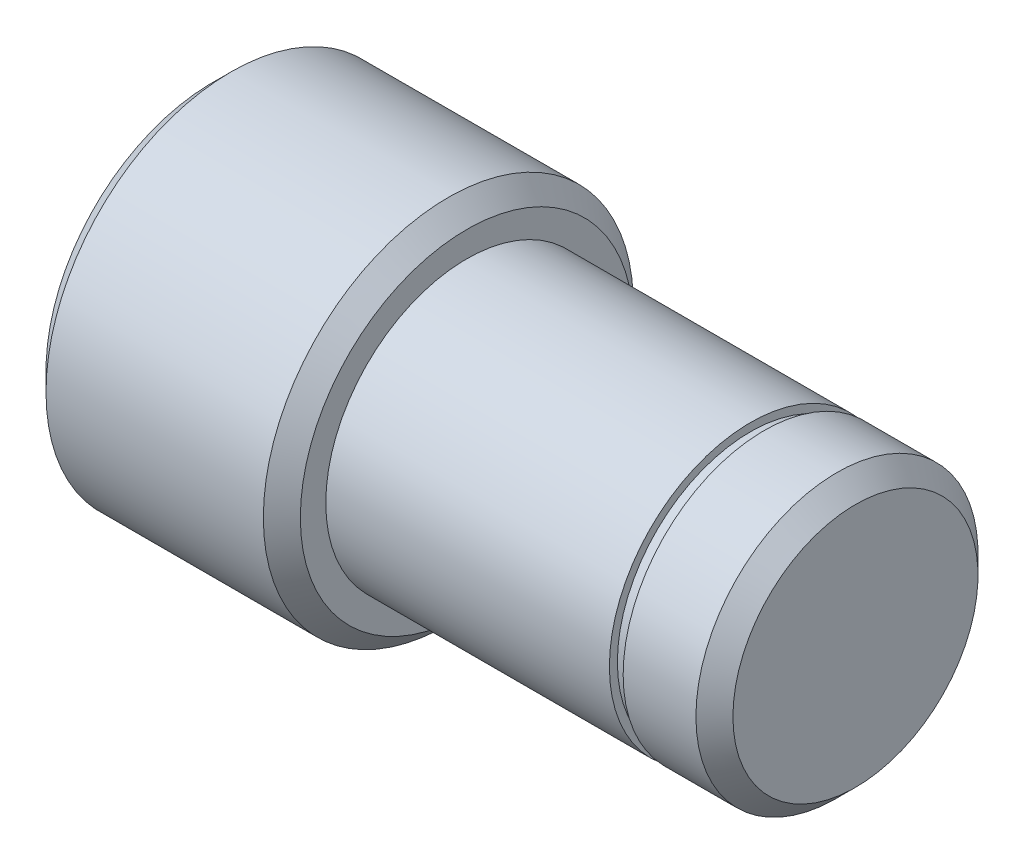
from build123d import *

# Parameters (mm, degrees)
CHAMFER1_SIZE      = 2.54
SKETCH2_R          = 2.413
CUT_EXTRUDE1_DEPTH = 6.35
SKETCH3_R          = 3.175
CUT_EXTRUDE2_DEPTH = 6.35
SKETCH4_W          = 1.890586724
SKETCH4_H          = 1.098603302


with BuildPart() as part:
    # Sketch1 → Revolve1 (revolve)
    with BuildSketch(Plane.XY, mode=Mode.PRIVATE) as revolve1_sk:
        Polygon((0, 0), (0, 25.4), (34.925, 25.4), (34.925, 19.3675), (88.2904, 19.3675), (88.2904, 0), align=None)
    revolve(revolve1_sk.sketch.rotate(Axis((0, 0, 0), (1, 0, 0)), 90), axis=Axis((0, 0, 0), (1, 0, 0)))

    # Chamfer1
    chamfer1_edges = [part.edges().sort_by_distance(p)[0] for p in [
        (88.2904, 0, -19.3675),
        (34.925, 0, -25.4),
        (0, 0, -25.4),
    ]]
    chamfer(chamfer1_edges, length=CHAMFER1_SIZE)

    # Sketch2 → Cut-Extrude1 (cut)
    with BuildSketch(Plane.ZY):
        with Locations((19.05, 0)):
            Circle(SKETCH2_R)
        with Locations((-19.05, 0)):
            Circle(SKETCH2_R)
    extrude(amount=-CUT_EXTRUDE1_DEPTH, mode=Mode.SUBTRACT)

    # Sketch3 → Cut-Extrude2 (cut)
    with BuildSketch(Plane.ZY):
        with Locations((0, -8.3566)):
            Circle(SKETCH3_R)
    extrude(amount=-CUT_EXTRUDE2_DEPTH, mode=Mode.SUBTRACT)

    # Sketch4 → Cut-Revolve1 (revolve, cut)
    with BuildSketch(Plane(origin=(0, 0, 0), x_dir=(1, 0, 0), z_dir=(0, 1, 0)), mode=Mode.PRIVATE) as cut_revolve1_sk:
        with Locations((74.814717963, 18.818198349)):
            Rectangle(SKETCH4_W, SKETCH4_H)
    revolve(cut_revolve1_sk.sketch.rotate(Axis((0, 0, 0), (1, 0, 0)), 180), axis=Axis((0, 0, 0), (1, 0, 0)), mode=Mode.SUBTRACT)


solid = part.part
